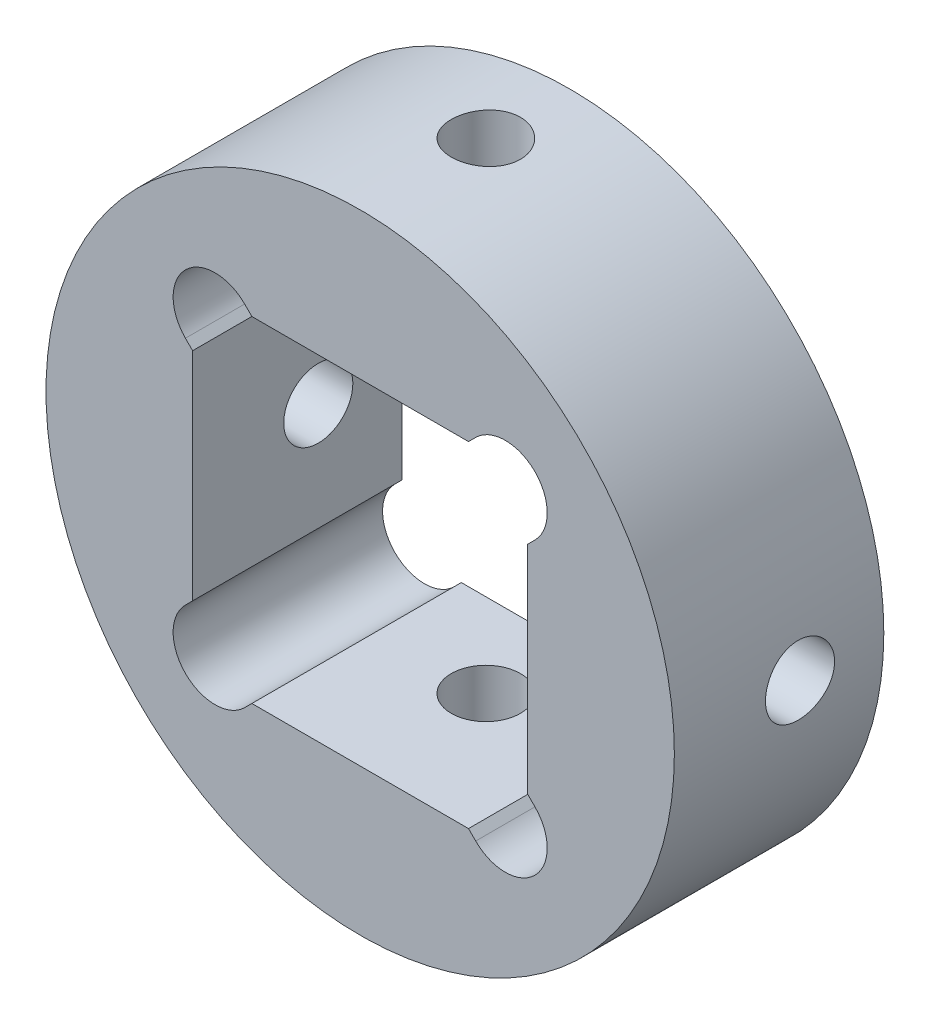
from build123d import *

# Parameters (mm, degrees)
BOSS_EXTRU_1_START           = -4
ESQUISSE1_R                  = 15
BOSS_EXTRU_1_DEPTH           = 10
TROU_TARAUD_M41_D            = 3.3
TROU_TARAUD_M41_DEPTH        = 7
R_P_TITION_CIRCULAIRE1_COUNT = 4


with BuildPart() as part:
    # Esquisse1 → Boss.-Extru.1 (new body)
    with BuildSketch(Plane.XY.offset(BOSS_EXTRU_1_START)):
        Circle(ESQUISSE1_R)
        with BuildLine():
            Line((-8, 5.171572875), (-8, -5.171572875))
            Line((-8, -5.171572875), (-8.343860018, -5.515432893))
            ThreePointArc((-8.343860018, -5.515432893), (-8.343860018, -8.343860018), (-5.515432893, -8.343860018))
            Line((-5.515432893, -8.343860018), (-5.171572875, -8))
            Line((-5.171572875, -8), (5.171572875, -8))
            Line((5.171572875, -8), (5.515432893, -8.343860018))
            ThreePointArc((5.515432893, -8.343860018), (8.343860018, -8.343860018), (8.343860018, -5.515432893))
            Line((8.343860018, -5.515432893), (8, -5.171572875))
            Line((8, -5.171572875), (8, 5.171572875))
            Line((8, 5.171572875), (8.343860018, 5.515432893))
            ThreePointArc((8.343860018, 5.515432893), (8.343860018, 8.343860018), (5.515432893, 8.343860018))
            Line((5.515432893, 8.343860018), (5.171572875, 8))
            Line((5.171572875, 8), (-5.171572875, 8))
            Line((-5.171572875, 8), (-5.515432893, 8.343860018))
            ThreePointArc((-5.515432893, 8.343860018), (-8.343860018, 8.343860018), (-8.343860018, 5.515432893))
            Line((-8.343860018, 5.515432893), (-8, 5.171572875))
        make_face(mode=Mode.SUBTRACT)
    extrude(amount=BOSS_EXTRU_1_DEPTH)

    # Trou taraud_ M41
    with Locations(Plane(origin=(0, -8, 0), x_dir=(-1, 0, 0), z_dir=(0, 1, 0))):
        with Locations((0, 0)):
            trou_taraud_m41 = Hole(TROU_TARAUD_M41_D / 2, depth=TROU_TARAUD_M41_DEPTH)

    # R_p_tition circulaire1: Trou taraud_ M41 ×4 about axis
    r_p_tition_circulaire1_axis = Axis((0, 0, 6), (0, 0, -1))
    for i in range(1, R_P_TITION_CIRCULAIRE1_COUNT):
        add(trou_taraud_m41.rotate(r_p_tition_circulaire1_axis, i * 360 / R_P_TITION_CIRCULAIRE1_COUNT), mode=Mode.SUBTRACT)


solid = part.part
